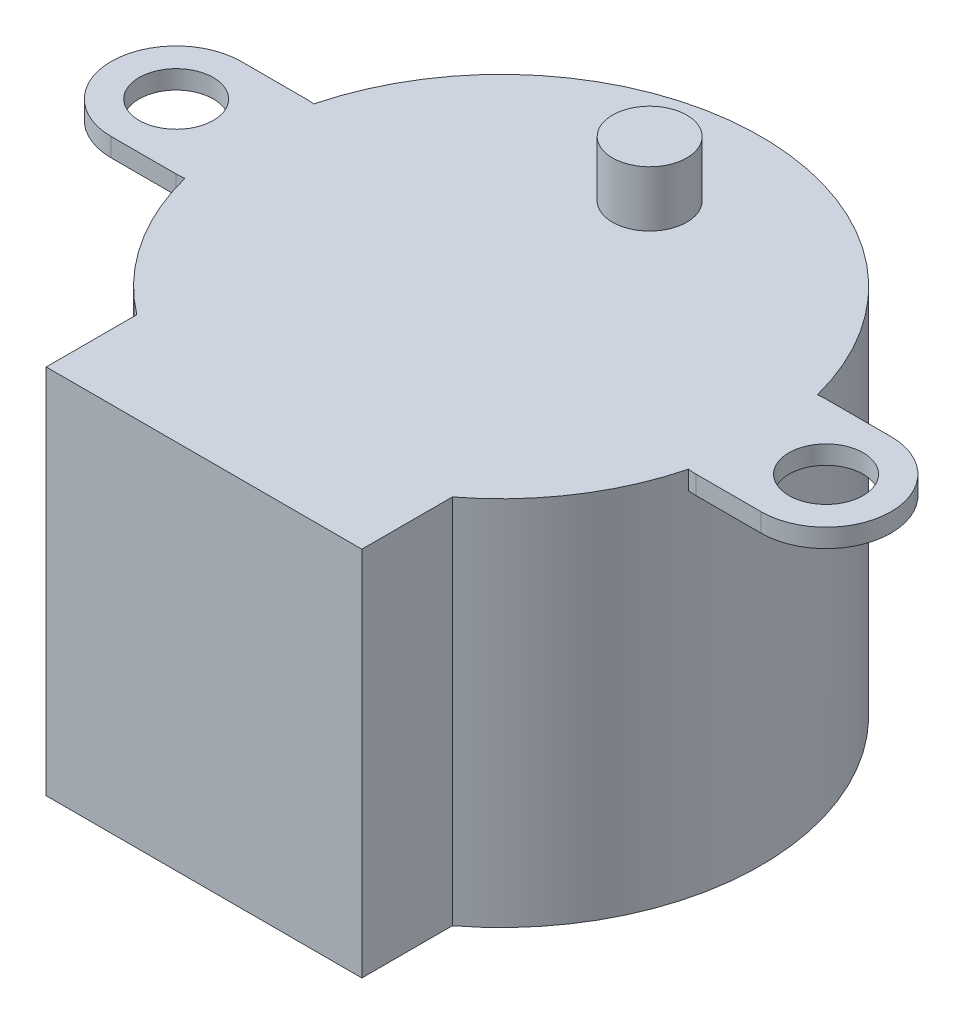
ISO-10303-21;
HEADER;
FILE_DESCRIPTION(('STEP AP214'),'2;1');
FILE_NAME('part.step','',(''),(''),'','','');
FILE_SCHEMA(('AUTOMOTIVE_DESIGN { 1 0 10303 214 1 1 1 1 }'));
ENDSEC;
DATA;
#1=APPLICATION_CONTEXT('core data for automotive mechanical design processes');
#2=APPLICATION_PROTOCOL_DEFINITION('international standard','automotive_design',2000,#1);
#3=PRODUCT_CONTEXT('',#1,'mechanical');
#4=PRODUCT('Part','Part','',(#3));
#5=PRODUCT_RELATED_PRODUCT_CATEGORY('part','',(#4));
#6=PRODUCT_DEFINITION_FORMATION('','',#4);
#7=PRODUCT_DEFINITION_CONTEXT('part definition',#1,'design');
#8=PRODUCT_DEFINITION('design','',#6,#7);
#9=PRODUCT_DEFINITION_SHAPE('','',#8);
#10=(LENGTH_UNIT() NAMED_UNIT(*) SI_UNIT(.MILLI.,.METRE.));
#11=(NAMED_UNIT(*) PLANE_ANGLE_UNIT() SI_UNIT($,.RADIAN.));
#12=(NAMED_UNIT(*) SI_UNIT($,.STERADIAN.) SOLID_ANGLE_UNIT());
#13=UNCERTAINTY_MEASURE_WITH_UNIT(LENGTH_MEASURE(1.E-05),#10,'distance_accuracy_value','');
#14=(GEOMETRIC_REPRESENTATION_CONTEXT(3) GLOBAL_UNCERTAINTY_ASSIGNED_CONTEXT((#13)) GLOBAL_UNIT_ASSIGNED_CONTEXT((#10,
#11,#12)) REPRESENTATION_CONTEXT('',''));
#15=CARTESIAN_POINT('',(0.,0.,0.));
#16=DIRECTION('',(0.,0.,1.));
#17=DIRECTION('',(1.,0.,0.));
#18=AXIS2_PLACEMENT_3D('',#15,#16,#17);
#19=CARTESIAN_POINT('',(0.,20.,0.));
#20=DIRECTION('',(0.,-1.,0.));
#21=DIRECTION('',(0.,0.,-1.));
#22=AXIS2_PLACEMENT_3D('',#19,#20,#21);
#23=CYLINDRICAL_SURFACE('',#22,14.);
#24=CARTESIAN_POINT('',(0.,19.,0.));
#25=DIRECTION('',(0.,-1.,0.));
#26=DIRECTION('',(0.,0.,-1.));
#27=AXIS2_PLACEMENT_3D('',#24,#25,#26);
#28=CIRCLE('',#27,14.);
#29=CARTESIAN_POINT('',(-13.5625,19.,3.47254859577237));
#30=VERTEX_POINT('',#29);
#31=CARTESIAN_POINT('',(-13.5625,19.,-3.47254859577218));
#32=VERTEX_POINT('',#31);
#33=EDGE_CURVE('E11',#30,#32,#28,.T.);
#34=ORIENTED_EDGE('',*,*,#33,.T.);
#35=DIRECTION('',(0.,1.,0.));
#36=VECTOR('',#35,1.);
#37=CARTESIAN_POINT('',(-13.5625,19.5,-3.47254859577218));
#38=LINE('',#37,#36);
#39=CARTESIAN_POINT('',(-13.5625,20.,-3.47254859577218));
#40=VERTEX_POINT('',#39);
#41=EDGE_CURVE('E152',#32,#40,#38,.T.);
#42=ORIENTED_EDGE('',*,*,#41,.T.);
#43=CARTESIAN_POINT('',(0.,20.,0.));
#44=DIRECTION('',(0.,1.,0.));
#45=DIRECTION('',(0.,0.,1.));
#46=AXIS2_PLACEMENT_3D('',#43,#44,#45);
#47=CIRCLE('',#46,14.);
#48=CARTESIAN_POINT('',(13.5625,20.,-3.47254859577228));
#49=VERTEX_POINT('',#48);
#50=EDGE_CURVE('E245',#49,#40,#47,.T.);
#51=ORIENTED_EDGE('',*,*,#50,.F.);
#52=DIRECTION('',(0.,1.,0.));
#53=VECTOR('',#52,1.);
#54=CARTESIAN_POINT('',(13.5625,19.5,-3.47254859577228));
#55=LINE('',#54,#53);
#56=CARTESIAN_POINT('',(13.5625,19.,-3.47254859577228));
#57=VERTEX_POINT('',#56);
#58=EDGE_CURVE('E228',#49,#57,#55,.F.);
#59=ORIENTED_EDGE('',*,*,#58,.T.);
#60=CARTESIAN_POINT('',(0.,19.,0.));
#61=DIRECTION('',(0.,1.,0.));
#62=DIRECTION('',(0.,0.,1.));
#63=AXIS2_PLACEMENT_3D('',#60,#61,#62);
#64=CIRCLE('',#63,14.);
#65=CARTESIAN_POINT('',(13.5625,19.,3.47254859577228));
#66=VERTEX_POINT('',#65);
#67=EDGE_CURVE('E39',#66,#57,#64,.T.);
#68=ORIENTED_EDGE('',*,*,#67,.F.);
#69=DIRECTION('',(0.,1.,0.));
#70=VECTOR('',#69,1.);
#71=CARTESIAN_POINT('',(13.5625,19.5,3.47254859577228));
#72=LINE('',#71,#70);
#73=CARTESIAN_POINT('',(13.5625,20.,3.47254859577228));
#74=VERTEX_POINT('',#73);
#75=EDGE_CURVE('E237',#66,#74,#72,.T.);
#76=ORIENTED_EDGE('',*,*,#75,.T.);
#77=CARTESIAN_POINT('',(8.5,20.,11.1242977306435));
#78=VERTEX_POINT('',#77);
#79=EDGE_CURVE('E241',#78,#74,#47,.T.);
#80=ORIENTED_EDGE('',*,*,#79,.F.);
#81=DIRECTION('',(0.,-1.,0.));
#82=VECTOR('',#81,1.);
#83=CARTESIAN_POINT('',(8.5,20.,11.1242977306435));
#84=LINE('',#83,#82);
#85=CARTESIAN_POINT('',(8.5,0.,11.1242977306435));
#86=VERTEX_POINT('',#85);
#87=EDGE_CURVE('E253',#78,#86,#84,.T.);
#88=ORIENTED_EDGE('',*,*,#87,.T.);
#89=CARTESIAN_POINT('',(0.,0.,0.));
#90=DIRECTION('',(0.,1.,0.));
#91=DIRECTION('',(0.,0.,1.));
#92=AXIS2_PLACEMENT_3D('',#89,#90,#91);
#93=CIRCLE('',#92,14.);
#94=CARTESIAN_POINT('',(-8.5,0.,11.1242977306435));
#95=VERTEX_POINT('',#94);
#96=EDGE_CURVE('E240',#86,#95,#93,.T.);
#97=ORIENTED_EDGE('',*,*,#96,.T.);
#98=DIRECTION('',(0.,-1.,0.));
#99=VECTOR('',#98,1.);
#100=CARTESIAN_POINT('',(-8.5,20.,11.1242977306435));
#101=LINE('',#100,#99);
#102=CARTESIAN_POINT('',(-8.5,20.,11.1242977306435));
#103=VERTEX_POINT('',#102);
#104=EDGE_CURVE('E270',#103,#95,#101,.T.);
#105=ORIENTED_EDGE('',*,*,#104,.F.);
#106=CARTESIAN_POINT('',(-13.5625,20.,3.47254859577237));
#107=VERTEX_POINT('',#106);
#108=EDGE_CURVE('E246',#107,#103,#47,.T.);
#109=ORIENTED_EDGE('',*,*,#108,.F.);
#110=DIRECTION('',(0.,1.,0.));
#111=VECTOR('',#110,1.);
#112=CARTESIAN_POINT('',(-13.5625,19.5,3.47254859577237));
#113=LINE('',#112,#111);
#114=EDGE_CURVE('E189',#107,#30,#113,.F.);
#115=ORIENTED_EDGE('',*,*,#114,.T.);
#116=EDGE_LOOP('',(#34,#42,#51,#59,#68,#76,#80,#88,#97,#105,#109,#115));
#117=FACE_BOUND('',#116,.T.);
#118=ADVANCED_FACE('F32',(#117),#23,.T.);
#119=CARTESIAN_POINT('',(-8.49999999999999,20.,0.));
#120=DIRECTION('',(1.,0.,0.));
#121=DIRECTION('',(0.,0.,-1.));
#122=AXIS2_PLACEMENT_3D('',#119,#120,#121);
#123=PLANE('',#122);
#124=DIRECTION('',(0.,0.,1.));
#125=VECTOR('',#124,1.);
#126=CARTESIAN_POINT('',(-8.49999999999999,0.,0.));
#127=LINE('',#126,#125);
#128=CARTESIAN_POINT('',(-8.5,0.,16.));
#129=VERTEX_POINT('',#128);
#130=EDGE_CURVE('E256',#95,#129,#127,.T.);
#131=ORIENTED_EDGE('',*,*,#130,.T.);
#132=DIRECTION('',(0.,-1.,0.));
#133=VECTOR('',#132,1.);
#134=CARTESIAN_POINT('',(-8.5,20.,16.));
#135=LINE('',#134,#133);
#136=CARTESIAN_POINT('',(-8.5,20.,16.));
#137=VERTEX_POINT('',#136);
#138=EDGE_CURVE('E267',#137,#129,#135,.T.);
#139=ORIENTED_EDGE('',*,*,#138,.F.);
#140=DIRECTION('',(0.,0.,1.));
#141=VECTOR('',#140,1.);
#142=CARTESIAN_POINT('',(-8.49999999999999,20.,0.));
#143=LINE('',#142,#141);
#144=EDGE_CURVE('E244',#103,#137,#143,.T.);
#145=ORIENTED_EDGE('',*,*,#144,.F.);
#146=ORIENTED_EDGE('',*,*,#104,.T.);
#147=EDGE_LOOP('',(#131,#139,#145,#146));
#148=FACE_BOUND('',#147,.T.);
#149=ADVANCED_FACE('F290',(#148),#123,.F.);
#150=CARTESIAN_POINT('',(0.,20.,16.));
#151=DIRECTION('',(0.,0.,-1.));
#152=DIRECTION('',(-1.,0.,0.));
#153=AXIS2_PLACEMENT_3D('',#150,#151,#152);
#154=PLANE('',#153);
#155=DIRECTION('',(1.,0.,0.));
#156=VECTOR('',#155,1.);
#157=CARTESIAN_POINT('',(0.,0.,16.));
#158=LINE('',#157,#156);
#159=CARTESIAN_POINT('',(8.5,0.,16.));
#160=VERTEX_POINT('',#159);
#161=EDGE_CURVE('E258',#129,#160,#158,.T.);
#162=ORIENTED_EDGE('',*,*,#161,.T.);
#163=DIRECTION('',(0.,-1.,0.));
#164=VECTOR('',#163,1.);
#165=CARTESIAN_POINT('',(8.5,20.,16.));
#166=LINE('',#165,#164);
#167=CARTESIAN_POINT('',(8.5,20.,16.));
#168=VERTEX_POINT('',#167);
#169=EDGE_CURVE('E265',#168,#160,#166,.T.);
#170=ORIENTED_EDGE('',*,*,#169,.F.);
#171=DIRECTION('',(1.,0.,0.));
#172=VECTOR('',#171,1.);
#173=CARTESIAN_POINT('',(0.,20.,16.));
#174=LINE('',#173,#172);
#175=EDGE_CURVE('E248',#137,#168,#174,.T.);
#176=ORIENTED_EDGE('',*,*,#175,.F.);
#177=ORIENTED_EDGE('',*,*,#138,.T.);
#178=EDGE_LOOP('',(#162,#170,#176,#177));
#179=FACE_BOUND('',#178,.T.);
#180=ADVANCED_FACE('F303',(#179),#154,.F.);
#181=CARTESIAN_POINT('',(8.49999999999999,20.,0.));
#182=DIRECTION('',(1.,0.,0.));
#183=DIRECTION('',(0.,0.,-1.));
#184=AXIS2_PLACEMENT_3D('',#181,#182,#183);
#185=PLANE('',#184);
#186=DIRECTION('',(0.,0.,1.));
#187=VECTOR('',#186,1.);
#188=CARTESIAN_POINT('',(8.49999999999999,0.,0.));
#189=LINE('',#188,#187);
#190=EDGE_CURVE('E261',#86,#160,#189,.T.);
#191=ORIENTED_EDGE('',*,*,#190,.F.);
#192=ORIENTED_EDGE('',*,*,#87,.F.);
#193=DIRECTION('',(0.,0.,1.));
#194=VECTOR('',#193,1.);
#195=CARTESIAN_POINT('',(8.49999999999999,20.,0.));
#196=LINE('',#195,#194);
#197=EDGE_CURVE('E250',#78,#168,#196,.T.);
#198=ORIENTED_EDGE('',*,*,#197,.T.);
#199=ORIENTED_EDGE('',*,*,#169,.T.);
#200=EDGE_LOOP('',(#191,#192,#198,#199));
#201=FACE_BOUND('',#200,.T.);
#202=ADVANCED_FACE('F299',(#201),#185,.T.);
#203=CARTESIAN_POINT('',(0.,20.,0.));
#204=DIRECTION('',(0.,1.,0.));
#205=DIRECTION('',(0.,0.,1.));
#206=AXIS2_PLACEMENT_3D('',#203,#204,#205);
#207=PLANE('',#206);
#208=CARTESIAN_POINT('',(0.,20.,-8.));
#209=DIRECTION('',(0.,1.,0.));
#210=DIRECTION('',(0.,0.,1.));
#211=AXIS2_PLACEMENT_3D('',#208,#209,#210);
#212=CIRCLE('',#211,2.);
#213=CARTESIAN_POINT('',(0.,20.,-6.));
#214=VERTEX_POINT('',#213);
#215=EDGE_CURVE('E479',#214,#214,#212,.T.);
#216=ORIENTED_EDGE('',*,*,#215,.F.);
#217=EDGE_LOOP('',(#216));
#218=FACE_BOUND('',#217,.T.);
#219=ORIENTED_EDGE('',*,*,#50,.T.);
#220=CARTESIAN_POINT('',(-14.,20.,0.));
#221=DIRECTION('',(0.,1.,0.));
#222=DIRECTION('',(0.,0.,-1.));
#223=AXIS2_PLACEMENT_3D('',#220,#221,#222);
#224=CIRCLE('',#223,3.5);
#225=CARTESIAN_POINT('',(-14.,20.,-3.5));
#226=VERTEX_POINT('',#225);
#227=EDGE_CURVE('E181',#40,#226,#224,.T.);
#228=ORIENTED_EDGE('',*,*,#227,.T.);
#229=DIRECTION('',(-1.,0.,0.));
#230=VECTOR('',#229,1.);
#231=CARTESIAN_POINT('',(-14.,20.,-3.5));
#232=LINE('',#231,#230);
#233=CARTESIAN_POINT('',(-17.5,20.,-3.5));
#234=VERTEX_POINT('',#233);
#235=EDGE_CURVE('E163',#226,#234,#232,.T.);
#236=ORIENTED_EDGE('',*,*,#235,.T.);
#237=CARTESIAN_POINT('',(-17.5,20.,0.));
#238=DIRECTION('',(0.,1.,0.));
#239=DIRECTION('',(0.,0.,-1.));
#240=AXIS2_PLACEMENT_3D('',#237,#238,#239);
#241=CIRCLE('',#240,3.5);
#242=CARTESIAN_POINT('',(-17.5,20.,3.5));
#243=VERTEX_POINT('',#242);
#244=EDGE_CURVE('E183',#234,#243,#241,.T.);
#245=ORIENTED_EDGE('',*,*,#244,.T.);
#246=DIRECTION('',(1.,0.,0.));
#247=VECTOR('',#246,1.);
#248=CARTESIAN_POINT('',(-14.,20.,3.5));
#249=LINE('',#248,#247);
#250=CARTESIAN_POINT('',(-14.,20.,3.5));
#251=VERTEX_POINT('',#250);
#252=EDGE_CURVE('E156',#243,#251,#249,.T.);
#253=ORIENTED_EDGE('',*,*,#252,.T.);
#254=EDGE_CURVE('E46',#251,#107,#224,.T.);
#255=ORIENTED_EDGE('',*,*,#254,.T.);
#256=ORIENTED_EDGE('',*,*,#108,.T.);
#257=ORIENTED_EDGE('',*,*,#144,.T.);
#258=ORIENTED_EDGE('',*,*,#175,.T.);
#259=ORIENTED_EDGE('',*,*,#197,.F.);
#260=ORIENTED_EDGE('',*,*,#79,.T.);
#261=CARTESIAN_POINT('',(14.,20.,0.));
#262=DIRECTION('',(0.,1.,0.));
#263=DIRECTION('',(0.,0.,1.));
#264=AXIS2_PLACEMENT_3D('',#261,#262,#263);
#265=CIRCLE('',#264,3.5);
#266=CARTESIAN_POINT('',(14.,20.,3.5));
#267=VERTEX_POINT('',#266);
#268=EDGE_CURVE('E200',#74,#267,#265,.T.);
#269=ORIENTED_EDGE('',*,*,#268,.T.);
#270=DIRECTION('',(1.,0.,0.));
#271=VECTOR('',#270,1.);
#272=CARTESIAN_POINT('',(14.,20.,3.5));
#273=LINE('',#272,#271);
#274=CARTESIAN_POINT('',(17.5,20.,3.5));
#275=VERTEX_POINT('',#274);
#276=EDGE_CURVE('E218',#267,#275,#273,.T.);
#277=ORIENTED_EDGE('',*,*,#276,.T.);
#278=CARTESIAN_POINT('',(17.5,20.,0.));
#279=DIRECTION('',(0.,1.,0.));
#280=DIRECTION('',(0.,0.,1.));
#281=AXIS2_PLACEMENT_3D('',#278,#279,#280);
#282=CIRCLE('',#281,3.5);
#283=CARTESIAN_POINT('',(17.5,20.,-3.5));
#284=VERTEX_POINT('',#283);
#285=EDGE_CURVE('E221',#275,#284,#282,.T.);
#286=ORIENTED_EDGE('',*,*,#285,.T.);
#287=DIRECTION('',(-1.,0.,0.));
#288=VECTOR('',#287,1.);
#289=CARTESIAN_POINT('',(14.,20.,-3.5));
#290=LINE('',#289,#288);
#291=CARTESIAN_POINT('',(14.,20.,-3.5));
#292=VERTEX_POINT('',#291);
#293=EDGE_CURVE('E224',#284,#292,#290,.T.);
#294=ORIENTED_EDGE('',*,*,#293,.T.);
#295=EDGE_CURVE('E53',#292,#49,#265,.T.);
#296=ORIENTED_EDGE('',*,*,#295,.T.);
#297=EDGE_LOOP('',(#219,#228,#236,#245,#253,#255,#256,#257,#258,#259,#260,#269,#277,#286,#294,#296));
#298=FACE_BOUND('',#297,.T.);
#299=CARTESIAN_POINT('',(17.5,20.,0.));
#300=DIRECTION('',(0.,1.,0.));
#301=DIRECTION('',(0.,0.,1.));
#302=AXIS2_PLACEMENT_3D('',#299,#300,#301);
#303=CIRCLE('',#302,2.);
#304=CARTESIAN_POINT('',(17.5,20.,2.));
#305=VERTEX_POINT('',#304);
#306=EDGE_CURVE('E196',#305,#305,#303,.T.);
#307=ORIENTED_EDGE('',*,*,#306,.F.);
#308=EDGE_LOOP('',(#307));
#309=FACE_BOUND('',#308,.T.);
#310=CARTESIAN_POINT('',(-17.5,20.,0.));
#311=DIRECTION('',(0.,1.,0.));
#312=DIRECTION('',(0.,0.,-1.));
#313=AXIS2_PLACEMENT_3D('',#310,#311,#312);
#314=CIRCLE('',#313,2.);
#315=CARTESIAN_POINT('',(-17.5,20.,-2.00000000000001));
#316=VERTEX_POINT('',#315);
#317=EDGE_CURVE('E478',#316,#316,#314,.T.);
#318=ORIENTED_EDGE('',*,*,#317,.F.);
#319=EDGE_LOOP('',(#318));
#320=FACE_BOUND('',#319,.T.);
#321=ADVANCED_FACE('F285',(#218,#298,#309,#320),#207,.T.);
#322=CARTESIAN_POINT('',(0.,0.,0.));
#323=DIRECTION('',(0.,1.,0.));
#324=DIRECTION('',(0.,0.,1.));
#325=AXIS2_PLACEMENT_3D('',#322,#323,#324);
#326=PLANE('',#325);
#327=ORIENTED_EDGE('',*,*,#96,.F.);
#328=ORIENTED_EDGE('',*,*,#190,.T.);
#329=ORIENTED_EDGE('',*,*,#161,.F.);
#330=ORIENTED_EDGE('',*,*,#130,.F.);
#331=EDGE_LOOP('',(#327,#328,#329,#330));
#332=FACE_BOUND('',#331,.T.);
#333=ADVANCED_FACE('F296',(#332),#326,.F.);
#334=CARTESIAN_POINT('',(14.,19.,0.));
#335=DIRECTION('',(0.,1.,0.));
#336=DIRECTION('',(0.,0.,1.));
#337=AXIS2_PLACEMENT_3D('',#334,#335,#336);
#338=CYLINDRICAL_SURFACE('',#337,3.5);
#339=ORIENTED_EDGE('',*,*,#75,.F.);
#340=CARTESIAN_POINT('',(14.,19.,0.));
#341=DIRECTION('',(0.,1.,0.));
#342=DIRECTION('',(0.,0.,1.));
#343=AXIS2_PLACEMENT_3D('',#340,#341,#342);
#344=CIRCLE('',#343,3.5);
#345=CARTESIAN_POINT('',(14.,19.,3.5));
#346=VERTEX_POINT('',#345);
#347=EDGE_CURVE('E207',#66,#346,#344,.T.);
#348=ORIENTED_EDGE('',*,*,#347,.T.);
#349=DIRECTION('',(0.,1.,0.));
#350=VECTOR('',#349,1.);
#351=CARTESIAN_POINT('',(14.,19.,3.5));
#352=LINE('',#351,#350);
#353=EDGE_CURVE('E216',#346,#267,#352,.T.);
#354=ORIENTED_EDGE('',*,*,#353,.T.);
#355=ORIENTED_EDGE('',*,*,#268,.F.);
#356=EDGE_LOOP('',(#339,#348,#354,#355));
#357=FACE_BOUND('',#356,.T.);
#358=ADVANCED_FACE('F305',(#357),#338,.T.);
#359=ORIENTED_EDGE('',*,*,#58,.F.);
#360=ORIENTED_EDGE('',*,*,#295,.F.);
#361=DIRECTION('',(0.,1.,0.));
#362=VECTOR('',#361,1.);
#363=CARTESIAN_POINT('',(14.,19.,-3.5));
#364=LINE('',#363,#362);
#365=CARTESIAN_POINT('',(14.,19.,-3.5));
#366=VERTEX_POINT('',#365);
#367=EDGE_CURVE('E226',#366,#292,#364,.T.);
#368=ORIENTED_EDGE('',*,*,#367,.F.);
#369=EDGE_CURVE('E203',#366,#57,#344,.T.);
#370=ORIENTED_EDGE('',*,*,#369,.T.);
#371=EDGE_LOOP('',(#359,#360,#368,#370));
#372=FACE_BOUND('',#371,.T.);
#373=ADVANCED_FACE('F281',(#372),#338,.T.);
#374=CARTESIAN_POINT('',(14.,19.,-3.5));
#375=DIRECTION('',(0.,0.,-1.));
#376=DIRECTION('',(-1.,0.,0.));
#377=AXIS2_PLACEMENT_3D('',#374,#375,#376);
#378=PLANE('',#377);
#379=ORIENTED_EDGE('',*,*,#293,.F.);
#380=DIRECTION('',(0.,1.,0.));
#381=VECTOR('',#380,1.);
#382=CARTESIAN_POINT('',(17.5,19.,-3.5));
#383=LINE('',#382,#381);
#384=CARTESIAN_POINT('',(17.5,19.,-3.5));
#385=VERTEX_POINT('',#384);
#386=EDGE_CURVE('E229',#385,#284,#383,.T.);
#387=ORIENTED_EDGE('',*,*,#386,.F.);
#388=DIRECTION('',(-1.,0.,0.));
#389=VECTOR('',#388,1.);
#390=CARTESIAN_POINT('',(14.,19.,-3.5));
#391=LINE('',#390,#389);
#392=EDGE_CURVE('E213',#385,#366,#391,.T.);
#393=ORIENTED_EDGE('',*,*,#392,.T.);
#394=ORIENTED_EDGE('',*,*,#367,.T.);
#395=EDGE_LOOP('',(#379,#387,#393,#394));
#396=FACE_BOUND('',#395,.T.);
#397=ADVANCED_FACE('F314',(#396),#378,.T.);
#398=CARTESIAN_POINT('',(17.5,19.,0.));
#399=DIRECTION('',(0.,1.,0.));
#400=DIRECTION('',(0.,0.,1.));
#401=AXIS2_PLACEMENT_3D('',#398,#399,#400);
#402=CYLINDRICAL_SURFACE('',#401,3.5);
#403=ORIENTED_EDGE('',*,*,#285,.F.);
#404=DIRECTION('',(0.,1.,0.));
#405=VECTOR('',#404,1.);
#406=CARTESIAN_POINT('',(17.5,19.,3.5));
#407=LINE('',#406,#405);
#408=CARTESIAN_POINT('',(17.5,19.,3.5));
#409=VERTEX_POINT('',#408);
#410=EDGE_CURVE('E231',#409,#275,#407,.T.);
#411=ORIENTED_EDGE('',*,*,#410,.F.);
#412=CARTESIAN_POINT('',(17.5,19.,0.));
#413=DIRECTION('',(0.,1.,0.));
#414=DIRECTION('',(0.,0.,1.));
#415=AXIS2_PLACEMENT_3D('',#412,#413,#414);
#416=CIRCLE('',#415,3.5);
#417=EDGE_CURVE('E210',#409,#385,#416,.T.);
#418=ORIENTED_EDGE('',*,*,#417,.T.);
#419=ORIENTED_EDGE('',*,*,#386,.T.);
#420=EDGE_LOOP('',(#403,#411,#418,#419));
#421=FACE_BOUND('',#420,.T.);
#422=ADVANCED_FACE('F316',(#421),#402,.T.);
#423=CARTESIAN_POINT('',(14.,19.,3.5));
#424=DIRECTION('',(0.,0.,1.));
#425=DIRECTION('',(1.,0.,0.));
#426=AXIS2_PLACEMENT_3D('',#423,#424,#425);
#427=PLANE('',#426);
#428=ORIENTED_EDGE('',*,*,#276,.F.);
#429=ORIENTED_EDGE('',*,*,#353,.F.);
#430=DIRECTION('',(1.,0.,0.));
#431=VECTOR('',#430,1.);
#432=CARTESIAN_POINT('',(14.,19.,3.5));
#433=LINE('',#432,#431);
#434=EDGE_CURVE('E206',#346,#409,#433,.T.);
#435=ORIENTED_EDGE('',*,*,#434,.T.);
#436=ORIENTED_EDGE('',*,*,#410,.T.);
#437=EDGE_LOOP('',(#428,#429,#435,#436));
#438=FACE_BOUND('',#437,.T.);
#439=ADVANCED_FACE('F309',(#438),#427,.T.);
#440=CARTESIAN_POINT('',(14.,19.,0.));
#441=DIRECTION('',(0.,1.,0.));
#442=DIRECTION('',(0.,0.,1.));
#443=AXIS2_PLACEMENT_3D('',#440,#441,#442);
#444=PLANE('',#443);
#445=CARTESIAN_POINT('',(17.5,19.,0.));
#446=DIRECTION('',(0.,1.,0.));
#447=DIRECTION('',(0.,0.,1.));
#448=AXIS2_PLACEMENT_3D('',#445,#446,#447);
#449=CIRCLE('',#448,2.);
#450=CARTESIAN_POINT('',(17.5,19.,2.));
#451=VERTEX_POINT('',#450);
#452=EDGE_CURVE('E197',#451,#451,#449,.T.);
#453=ORIENTED_EDGE('',*,*,#452,.T.);
#454=EDGE_LOOP('',(#453));
#455=FACE_BOUND('',#454,.T.);
#456=ORIENTED_EDGE('',*,*,#347,.F.);
#457=ORIENTED_EDGE('',*,*,#67,.T.);
#458=ORIENTED_EDGE('',*,*,#369,.F.);
#459=ORIENTED_EDGE('',*,*,#392,.F.);
#460=ORIENTED_EDGE('',*,*,#417,.F.);
#461=ORIENTED_EDGE('',*,*,#434,.F.);
#462=EDGE_LOOP('',(#456,#457,#458,#459,#460,#461));
#463=FACE_BOUND('',#462,.T.);
#464=ADVANCED_FACE('F276',(#455,#463),#444,.F.);
#465=CARTESIAN_POINT('',(17.5,19.,0.));
#466=DIRECTION('',(0.,1.,0.));
#467=DIRECTION('',(0.,0.,1.));
#468=AXIS2_PLACEMENT_3D('',#465,#466,#467);
#469=CYLINDRICAL_SURFACE('',#468,2.);
#470=ORIENTED_EDGE('',*,*,#452,.F.);
#471=EDGE_LOOP('',(#470));
#472=FACE_BOUND('',#471,.T.);
#473=ORIENTED_EDGE('',*,*,#306,.T.);
#474=EDGE_LOOP('',(#473));
#475=FACE_BOUND('',#474,.T.);
#476=ADVANCED_FACE('F370',(#472,#475),#469,.F.);
#477=CARTESIAN_POINT('',(-14.,19.,0.));
#478=DIRECTION('',(0.,1.,0.));
#479=DIRECTION('',(0.,0.,1.));
#480=AXIS2_PLACEMENT_3D('',#477,#478,#479);
#481=CYLINDRICAL_SURFACE('',#480,3.5);
#482=ORIENTED_EDGE('',*,*,#41,.F.);
#483=CARTESIAN_POINT('',(-14.,19.,0.));
#484=DIRECTION('',(0.,1.,0.));
#485=DIRECTION('',(0.,0.,-1.));
#486=AXIS2_PLACEMENT_3D('',#483,#484,#485);
#487=CIRCLE('',#486,3.5);
#488=CARTESIAN_POINT('',(-14.,19.,-3.5));
#489=VERTEX_POINT('',#488);
#490=EDGE_CURVE('E146',#32,#489,#487,.T.);
#491=ORIENTED_EDGE('',*,*,#490,.T.);
#492=DIRECTION('',(0.,1.,0.));
#493=VECTOR('',#492,1.);
#494=CARTESIAN_POINT('',(-14.,19.,-3.5));
#495=LINE('',#494,#493);
#496=EDGE_CURVE('E149',#489,#226,#495,.T.);
#497=ORIENTED_EDGE('',*,*,#496,.T.);
#498=ORIENTED_EDGE('',*,*,#227,.F.);
#499=EDGE_LOOP('',(#482,#491,#497,#498));
#500=FACE_BOUND('',#499,.T.);
#501=ADVANCED_FACE('F148',(#500),#481,.T.);
#502=ORIENTED_EDGE('',*,*,#114,.F.);
#503=ORIENTED_EDGE('',*,*,#254,.F.);
#504=DIRECTION('',(0.,1.,0.));
#505=VECTOR('',#504,1.);
#506=CARTESIAN_POINT('',(-14.,19.,3.5));
#507=LINE('',#506,#505);
#508=CARTESIAN_POINT('',(-14.,19.,3.5));
#509=VERTEX_POINT('',#508);
#510=EDGE_CURVE('E187',#509,#251,#507,.T.);
#511=ORIENTED_EDGE('',*,*,#510,.F.);
#512=EDGE_CURVE('E155',#509,#30,#487,.T.);
#513=ORIENTED_EDGE('',*,*,#512,.T.);
#514=EDGE_LOOP('',(#502,#503,#511,#513));
#515=FACE_BOUND('',#514,.T.);
#516=ADVANCED_FACE('F389',(#515),#481,.T.);
#517=CARTESIAN_POINT('',(-14.,19.,3.5));
#518=DIRECTION('',(0.,0.,1.));
#519=DIRECTION('',(1.,0.,0.));
#520=AXIS2_PLACEMENT_3D('',#517,#518,#519);
#521=PLANE('',#520);
#522=ORIENTED_EDGE('',*,*,#252,.F.);
#523=DIRECTION('',(0.,1.,0.));
#524=VECTOR('',#523,1.);
#525=CARTESIAN_POINT('',(-17.5,19.,3.5));
#526=LINE('',#525,#524);
#527=CARTESIAN_POINT('',(-17.5,19.,3.5));
#528=VERTEX_POINT('',#527);
#529=EDGE_CURVE('E190',#528,#243,#526,.T.);
#530=ORIENTED_EDGE('',*,*,#529,.F.);
#531=DIRECTION('',(1.,0.,0.));
#532=VECTOR('',#531,1.);
#533=CARTESIAN_POINT('',(-14.,19.,3.5));
#534=LINE('',#533,#532);
#535=EDGE_CURVE('E165',#528,#509,#534,.T.);
#536=ORIENTED_EDGE('',*,*,#535,.T.);
#537=ORIENTED_EDGE('',*,*,#510,.T.);
#538=EDGE_LOOP('',(#522,#530,#536,#537));
#539=FACE_BOUND('',#538,.T.);
#540=ADVANCED_FACE('F398',(#539),#521,.T.);
#541=CARTESIAN_POINT('',(-17.5,19.,0.));
#542=DIRECTION('',(0.,1.,0.));
#543=DIRECTION('',(0.,0.,1.));
#544=AXIS2_PLACEMENT_3D('',#541,#542,#543);
#545=CYLINDRICAL_SURFACE('',#544,3.5);
#546=ORIENTED_EDGE('',*,*,#244,.F.);
#547=DIRECTION('',(0.,1.,0.));
#548=VECTOR('',#547,1.);
#549=CARTESIAN_POINT('',(-17.5,19.,-3.5));
#550=LINE('',#549,#548);
#551=CARTESIAN_POINT('',(-17.5,19.,-3.5));
#552=VERTEX_POINT('',#551);
#553=EDGE_CURVE('E164',#552,#234,#550,.T.);
#554=ORIENTED_EDGE('',*,*,#553,.F.);
#555=CARTESIAN_POINT('',(-17.5,19.,0.));
#556=DIRECTION('',(0.,1.,0.));
#557=DIRECTION('',(0.,0.,-1.));
#558=AXIS2_PLACEMENT_3D('',#555,#556,#557);
#559=CIRCLE('',#558,3.5);
#560=EDGE_CURVE('E172',#552,#528,#559,.T.);
#561=ORIENTED_EDGE('',*,*,#560,.T.);
#562=ORIENTED_EDGE('',*,*,#529,.T.);
#563=EDGE_LOOP('',(#546,#554,#561,#562));
#564=FACE_BOUND('',#563,.T.);
#565=ADVANCED_FACE('F407',(#564),#545,.T.);
#566=CARTESIAN_POINT('',(-14.,19.,-3.5));
#567=DIRECTION('',(0.,0.,-1.));
#568=DIRECTION('',(-1.,0.,0.));
#569=AXIS2_PLACEMENT_3D('',#566,#567,#568);
#570=PLANE('',#569);
#571=ORIENTED_EDGE('',*,*,#235,.F.);
#572=ORIENTED_EDGE('',*,*,#496,.F.);
#573=DIRECTION('',(-1.,0.,0.));
#574=VECTOR('',#573,1.);
#575=CARTESIAN_POINT('',(-14.,19.,-3.5));
#576=LINE('',#575,#574);
#577=EDGE_CURVE('E161',#489,#552,#576,.T.);
#578=ORIENTED_EDGE('',*,*,#577,.T.);
#579=ORIENTED_EDGE('',*,*,#553,.T.);
#580=EDGE_LOOP('',(#571,#572,#578,#579));
#581=FACE_BOUND('',#580,.T.);
#582=ADVANCED_FACE('F160',(#581),#570,.T.);
#583=CARTESIAN_POINT('',(-14.,19.,0.));
#584=DIRECTION('',(0.,-1.,0.));
#585=DIRECTION('',(0.,0.,-1.));
#586=AXIS2_PLACEMENT_3D('',#583,#584,#585);
#587=PLANE('',#586);
#588=ORIENTED_EDGE('',*,*,#33,.F.);
#589=ORIENTED_EDGE('',*,*,#512,.F.);
#590=ORIENTED_EDGE('',*,*,#535,.F.);
#591=ORIENTED_EDGE('',*,*,#560,.F.);
#592=ORIENTED_EDGE('',*,*,#577,.F.);
#593=ORIENTED_EDGE('',*,*,#490,.F.);
#594=EDGE_LOOP('',(#588,#589,#590,#591,#592,#593));
#595=FACE_BOUND('',#594,.T.);
#596=CARTESIAN_POINT('',(-17.5,19.,0.));
#597=DIRECTION('',(0.,1.,0.));
#598=DIRECTION('',(0.,0.,-1.));
#599=AXIS2_PLACEMENT_3D('',#596,#597,#598);
#600=CIRCLE('',#599,2.);
#601=CARTESIAN_POINT('',(-17.5,19.,-2.00000000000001));
#602=VERTEX_POINT('',#601);
#603=EDGE_CURVE('E482',#602,#602,#600,.T.);
#604=ORIENTED_EDGE('',*,*,#603,.T.);
#605=EDGE_LOOP('',(#604));
#606=FACE_BOUND('',#605,.T.);
#607=ADVANCED_FACE('F168',(#595,#606),#587,.T.);
#608=CARTESIAN_POINT('',(-17.5,19.,0.));
#609=DIRECTION('',(0.,1.,0.));
#610=DIRECTION('',(0.,0.,1.));
#611=AXIS2_PLACEMENT_3D('',#608,#609,#610);
#612=CYLINDRICAL_SURFACE('',#611,2.);
#613=ORIENTED_EDGE('',*,*,#603,.F.);
#614=EDGE_LOOP('',(#613));
#615=FACE_BOUND('',#614,.T.);
#616=ORIENTED_EDGE('',*,*,#317,.T.);
#617=EDGE_LOOP('',(#616));
#618=FACE_BOUND('',#617,.T.);
#619=ADVANCED_FACE('F434',(#615,#618),#612,.F.);
#620=CARTESIAN_POINT('',(0.,23.,-8.));
#621=DIRECTION('',(0.,-1.,0.));
#622=DIRECTION('',(0.,0.,-1.));
#623=AXIS2_PLACEMENT_3D('',#620,#621,#622);
#624=CYLINDRICAL_SURFACE('',#623,2.);
#625=CARTESIAN_POINT('',(0.,23.,-8.));
#626=DIRECTION('',(0.,1.,0.));
#627=DIRECTION('',(0.,0.,1.));
#628=AXIS2_PLACEMENT_3D('',#625,#626,#627);
#629=CIRCLE('',#628,2.);
#630=CARTESIAN_POINT('',(0.,23.,-6.));
#631=VERTEX_POINT('',#630);
#632=EDGE_CURVE('E477',#631,#631,#629,.T.);
#633=ORIENTED_EDGE('',*,*,#632,.F.);
#634=EDGE_LOOP('',(#633));
#635=FACE_BOUND('',#634,.T.);
#636=ORIENTED_EDGE('',*,*,#215,.T.);
#637=EDGE_LOOP('',(#636));
#638=FACE_BOUND('',#637,.T.);
#639=ADVANCED_FACE('F443',(#635,#638),#624,.T.);
#640=CARTESIAN_POINT('',(0.,23.,-8.));
#641=DIRECTION('',(0.,1.,0.));
#642=DIRECTION('',(0.,0.,1.));
#643=AXIS2_PLACEMENT_3D('',#640,#641,#642);
#644=PLANE('',#643);
#645=ORIENTED_EDGE('',*,*,#632,.T.);
#646=EDGE_LOOP('',(#645));
#647=FACE_BOUND('',#646,.T.);
#648=ADVANCED_FACE('F461',(#647),#644,.T.);
#649=CLOSED_SHELL('',(#118,#149,#180,#202,#321,#333,#358,#373,#397,#422,#439,#464,#476,#501,
#516,#540,#565,#582,#607,#619,#639,#648));
#650=MANIFOLD_SOLID_BREP('B2',#649);
#651=ADVANCED_BREP_SHAPE_REPRESENTATION('',(#18,#650),#14);
#652=SHAPE_DEFINITION_REPRESENTATION(#9,#651);
ENDSEC;
END-ISO-10303-21;
